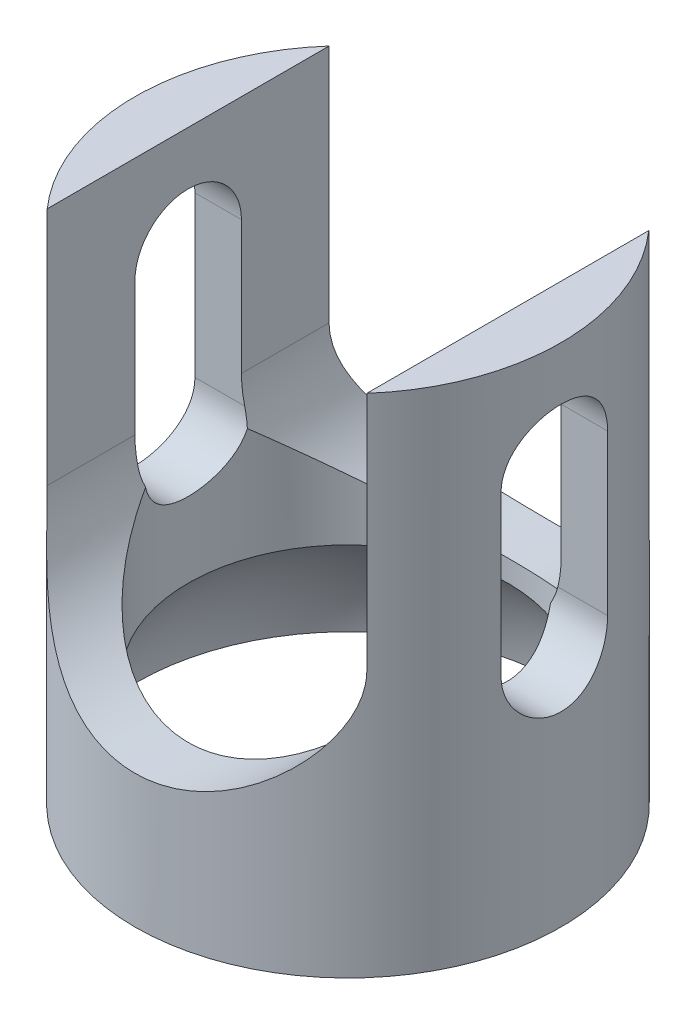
from build123d import *
from build123d.topology import SkipClean

# Parameters (mm, degrees)
SKETCH2_R               = 4
SKETCH2_R_2             = 3
BOSS_EXTRUDE1_DEPTH     = 9.5
CUT_EXTRUDE1_DEPTH      = 12.056672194
CUT_EXTRUDE1_DEPTH_BACK = 12.056672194
CUT_EXTRUDE2_DEPTH      = 12.056672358
CUT_EXTRUDE2_DEPTH_BACK = 12.056672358


with BuildPart() as part:
    # Sketch2 → Boss-Extrude1 (new body)
    with BuildSketch(Plane(origin=(0, 0, 0), x_dir=(1, 0, 0), z_dir=(0, 1, 0))):
        with Locations(Location((0, 0, 0), (0, 0, 270))):
            Circle(SKETCH2_R)
        with Locations(Location((0, 0, 0), (0, 0, 270))):
            Circle(SKETCH2_R_2, mode=Mode.SUBTRACT)
    extrude(amount=-BOSS_EXTRUDE1_DEPTH)

    # Sketch4 → Cut-Extrude1 (cut, two sides: drawn at the far end of the back side and taken through both)
    with BuildSketch(Plane(origin=(0, 0, 0), x_dir=(0, 0, -1), z_dir=(1, 0, 0)).offset(-CUT_EXTRUDE1_DEPTH_BACK)):
        with BuildLine():
            Line((-1, -2), (-1, -5))
            ThreePointArc((-1, -5), (0, -6), (1, -5))
            Line((1, -5), (1, -2))
            ThreePointArc((1, -2), (0, -1), (-1, -2))
        make_face()
    extrude(amount=CUT_EXTRUDE1_DEPTH + CUT_EXTRUDE1_DEPTH_BACK, mode=Mode.SUBTRACT)

    # Sketch5 → Cut-Extrude2 (cut, two sides: drawn at the far end of the back side and taken through both)
    with BuildSketch(Plane.XY.offset(-CUT_EXTRUDE2_DEPTH_BACK)):
        with BuildLine():
            Line((-3, 0), (-3, -4.5))
            add(Edge.make_bspline(
                [(-3, -4.5), (-3, -7), (0, -7), (3, -7), (3, -4.5)],
                knots=[3.141592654, 3.141592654, 3.141592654, 4.71238898, 4.71238898, 6.283185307, 6.283185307, 6.283185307], degree=2, weights=[1, 0.707106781, 1, 0.707106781, 1]))
            Line((3, -4.5), (3, 0))
            Line((3, 0), (-3, 0))
        make_face()
    extrude(amount=CUT_EXTRUDE2_DEPTH + CUT_EXTRUDE2_DEPTH_BACK, mode=Mode.SUBTRACT)

    # Sketch6 → Cut-Revolve3 (revolve, cut)
    with SkipClean():  # the faces are left unmerged after this step: merging them gives an invalid solid
        with BuildSketch(Plane.XY, mode=Mode.PRIVATE) as cut_revolve3_sk:
            with BuildLine():
                ThreePointArc((4, -10.054248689), (2.828427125, -7.225821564), (0, -6.054248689))
                Line((0, -6.054248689), (0, -14.054248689))
                ThreePointArc((0, -14.054248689), (2.828427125, -12.882675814), (4, -10.054248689))
            make_face()
            with BuildLine():
                Line((0, -14.054248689), (0, -6.054248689))
                ThreePointArc((0, -6.054248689), (-4, -10.054248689), (0, -14.054248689))
            make_face()
        revolve(cut_revolve3_sk.sketch.rotate(Axis((0, -5.027124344, 0), (0, -1, 0)), 90), axis=Axis((0, -5.027124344, 0), (0, -1, 0)), mode=Mode.SUBTRACT)


solid = part.part
